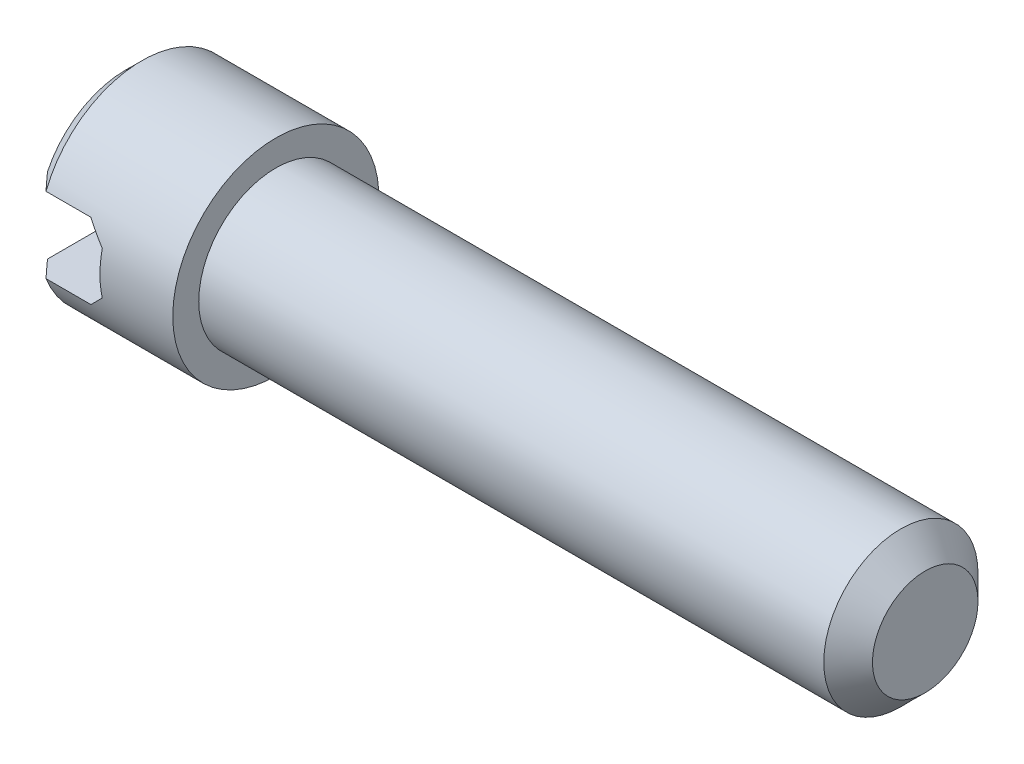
from build123d import *

# Parameters (mm, degrees)
ENL_V_MAT_EXTRU_1_DEPTH = 5
ESQUISSE3_R             = 0.95
EXTRUSION1_DEPTH        = 8
CHANFREIN1_SIZE         = 0.3


with BuildPart() as part:
    # Esquisse1 → R_volution1 (revolve)
    with BuildSketch(Plane.XY, mode=Mode.PRIVATE) as r_volution1_sk:
        Polygon((0, 0), (0, 1.07), (0.2, 1.27), (1.85, 1.27), (1.85, 0), align=None)
    revolve(r_volution1_sk.sketch.rotate(Axis((0, 0, 0), (1, 0, 0)), 90), axis=Axis((0, 0, 0), (1, 0, 0)))

    # Esquisse2 → Enl_v. mat.-Extru.1 (cut, symmetric)
    with BuildSketch(Plane.XY):
        Polygon((0, 0.465549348), (0.753445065, 0.465549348), (0.953445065, 0.265549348), (0.953445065, -0.265549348), (0.753445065, -0.465549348), (0, -0.465549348), align=None)
    extrude(amount=ENL_V_MAT_EXTRU_1_DEPTH, both=True, mode=Mode.SUBTRACT)

    # Esquisse3 → Extrusion1 (add)
    with BuildSketch(Plane(origin=(1.85, 0, 0), x_dir=(0, 0, -1), z_dir=(1, 0, 0))):
        with Locations(Location((0, 0, 0), (0, 0, 180))):
            Circle(ESQUISSE3_R)
    extrude(amount=EXTRUSION1_DEPTH)

    # Chanfrein1
    chanfrein1_edges = [part.edges().sort_by_distance(p)[0] for p in [
        (9.85, 0, -0.95),
    ]]
    chamfer(chanfrein1_edges, length=CHANFREIN1_SIZE)


solid = part.part
